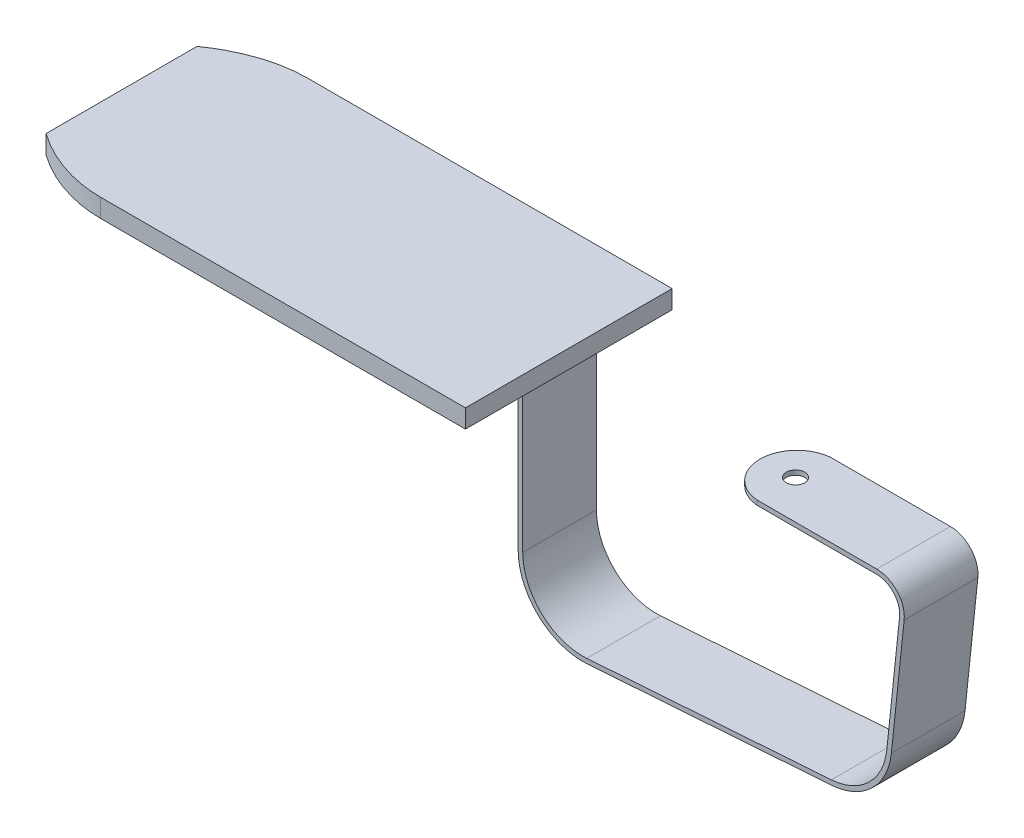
from build123d import *

# Parameters (mm, degrees)
BOSS_EXTRUDE1_DEPTH = 2.54
BOSS_EXTRUDE2_DEPTH = 1.27
BOSS_EXTRUDE4_DEPTH = 5.08
CUT_EXTRUDE1_DEPTH  = 10.16


with BuildPart() as part:
    # Sketch2 → Boss-Extrude1 (new body)
    with BuildSketch(Plane(origin=(0, 0, 0), x_dir=(1, 0, 0), z_dir=(0, 1, 0))):
        with BuildLine():
            Line((61.6585, 14.24305), (11.353119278, 14.24305))
            add(Edge.make_bspline(
                [(11.353119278, 14.24305), (10.327450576, 14.24305), (8.268396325, 14.047212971), (5.302466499, 13.251177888), (2.984919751, 12.238407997), (1.457568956, 11.373573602), (0.585224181, 10.807442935), (0.199247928, 10.543156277), (0, 10.408643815)],
                knots=[0, 0, 0, 0, 0.26559717, 0.53119434, 0.79679151, 0.929590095, 0.995989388, 1.06238868, 1.06238868, 1.06238868, 1.06238868], degree=3))
            Line((0, 10.408643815), (0, -10.408643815))
            add(Edge.make_bspline(
                [(0, -10.408643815), (0.199362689, -10.543233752), (0.585625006, -10.807716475), (1.458093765, -11.373904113), (2.984771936, -12.238095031), (5.290743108, -13.246690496), (8.260791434, -14.04631859), (10.325095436, -14.24305), (11.353119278, -14.24305)],
                knots=[-0.062352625, -0.062352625, -0.062352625, -0.062352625, 0.004044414, 0.070441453, 0.203235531, 0.468823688, 0.734411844, 1, 1, 1, 1], degree=3))
            Line((11.353119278, -14.24305), (61.6585, -14.24305))
            Line((61.6585, -14.24305), (61.6585, 14.24305))
        make_face()
        with BuildLine():
            Line((60.3885, 12.97305), (11.353119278, 12.97305))
            add(Edge.make_bspline(
                [(11.353119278, 12.97305), (10.450059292, 12.97305), (9.559200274, 12.892260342), (8.238540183, 12.667590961), (7.800947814, 12.575301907), (6.93079857, 12.357380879), (6.496809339, 12.231215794), (5.217581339, 11.809076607), (4.392169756, 11.469786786), (2.792058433, 10.684140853), (2.017192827, 10.23813493), (1.27, 9.733704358)],
                knots=[0, 0, 0, 0, 0.25, 0.25, 0.375, 0.375, 0.5, 0.5, 0.75, 0.75, 1, 1, 1, 1], degree=3))
            Line((1.27, 9.733704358), (1.27, -9.733704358))
            add(Edge.make_bspline(
                [(1.27, -9.733704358), (2.017624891, -10.238426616), (2.791972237, -10.684006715), (4.38895342, -11.46829921), (5.211756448, -11.806637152), (6.90950361, -12.3679143), (7.789205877, -12.590836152), (9.556782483, -12.892161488), (10.449674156, -12.97305), (11.353119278, -12.97305)],
                knots=[0, 0, 0, 0, 0.25, 0.25, 0.5, 0.5, 0.75, 0.75, 1, 1, 1, 1], degree=3))
            Line((11.353119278, -12.97305), (60.3885, -12.97305))
            Line((60.3885, -12.97305), (60.3885, 12.97305))
        make_face(mode=Mode.SUBTRACT)
    extrude(amount=-BOSS_EXTRUDE1_DEPTH)

    # Sketch3 → Boss-Extrude2 (add)
    with BuildSketch(Plane(origin=(0, 0, 0), x_dir=(1, 0, 0), z_dir=(0, 1, 0))):
        with BuildLine():
            Line((60.3885, 12.97305), (11.353119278, 12.97305))
            add(Edge.make_bspline(
                [(11.353119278, 12.97305), (10.450059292, 12.97305), (9.559200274, 12.892260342), (8.238540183, 12.667590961), (7.800947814, 12.575301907), (6.93079857, 12.357380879), (6.496809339, 12.231215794), (5.217581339, 11.809076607), (4.392169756, 11.469786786), (2.792058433, 10.684140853), (2.017192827, 10.23813493), (1.27, 9.733704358)],
                knots=[0, 0, 0, 0, 0.25, 0.25, 0.375, 0.375, 0.5, 0.5, 0.75, 0.75, 1, 1, 1, 1], degree=3))
            Line((1.27, 9.733704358), (1.27, -9.733704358))
            add(Edge.make_bspline(
                [(1.27, -9.733704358), (2.017624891, -10.238426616), (2.791972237, -10.684006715), (4.38895342, -11.46829921), (5.211756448, -11.806637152), (6.90950361, -12.3679143), (7.789205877, -12.590836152), (9.556782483, -12.892161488), (10.449674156, -12.97305), (11.353119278, -12.97305)],
                knots=[0, 0, 0, 0, 0.25, 0.25, 0.5, 0.5, 0.75, 0.75, 1, 1, 1, 1], degree=3))
            Line((11.353119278, -12.97305), (60.3885, -12.97305))
            Line((60.3885, -12.97305), (60.3885, 12.97305))
        make_face()
    extrude(amount=-BOSS_EXTRUDE2_DEPTH)


with BuildPart() as body_2:
    # Sketch4 → Boss-Extrude4 (new, symmetric)
    with BuildSketch(Plane.XY):
        with BuildLine():
            Line((59.7535, -2.54), (60.3885, -2.54))
            Line((60.3885, -2.54), (60.3885, -3.175))
            Line((60.3885, -3.175), (60.3885, -22.470642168))
            ThreePointArc((60.3885, -22.470642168), (63.013603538, -28.507966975), (69.219339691, -30.705533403))
            Line((69.219339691, -30.705533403), (102.944033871, -28.347273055))
            ThreePointArc((102.944033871, -28.347273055), (108.102599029, -26.050531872), (110.577972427, -20.975264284))
            Line((110.577972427, -20.975264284), (112.340926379, -4.201877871))
            ThreePointArc((112.340926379, -4.201877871), (111.542804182, -1.745510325), (109.183319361, -0.695))
            Line((109.183319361, -0.695), (88.014753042, -0.695))
            Line((88.014753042, -0.695), (88.014753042, -0.06))
            Line((88.014753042, -0.06), (109.183319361, -0.06))
            ThreePointArc((109.183319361, -0.06), (112.014701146, -1.32061239), (112.972447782, -4.268253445))
            Line((112.972447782, -4.268253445), (111.209493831, -21.041639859))
            ThreePointArc((111.209493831, -21.041639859), (108.543707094, -26.507312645), (102.988329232, -28.980726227))
            Line((102.988329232, -28.980726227), (69.263635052, -31.338986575))
            ThreePointArc((69.263635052, -31.338986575), (62.580534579, -28.972376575), (59.7535, -22.470642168))
            Line((59.7535, -22.470642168), (59.7535, -2.54))
        make_face()
    extrude(amount=BOSS_EXTRUDE4_DEPTH, both=True)

    # Sketch5 → Cut-Extrude1 (cut)
    with BuildSketch(Plane(origin=(0, -0.06, 0), x_dir=(1, 0, 0), z_dir=(0, 1, 0))):
        with BuildLine():
            Line((92.660699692, 5.08), (92.660699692, 6.643453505))
            Line((92.660699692, 6.643453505), (85.053554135, 6.643453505))
            Line((85.053554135, 6.643453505), (85.053554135, -6.84888771))
            Line((85.053554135, -6.84888771), (92.660699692, -6.84888771))
            Line((92.660699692, -6.84888771), (92.660699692, -5.08))
            ThreePointArc((92.660699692, -5.08), (88.014753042, 0), (92.660699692, 5.08))
        make_face()
        with BuildLine():
            add(Edge.make_bspline(
                [(93.930699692, 0.259119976), (93.930699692, 1.529114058), (92.660699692, 1.529114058), (91.390699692, 1.529114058), (91.390699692, 0.259119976)],
                knots=[3.141592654, 3.141592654, 3.141592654, 4.71238898, 4.71238898, 6.283185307, 6.283185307, 6.283185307], degree=2, weights=[1, 0.707106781, 1, 0.707106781, 1]))
            add(Edge.make_bspline(
                [(91.390699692, 0.259119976), (91.390699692, -1.010874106), (92.660699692, -1.010874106), (93.930699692, -1.010874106), (93.930699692, 0.259119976)],
                knots=[0, 0, 0, 1.570796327, 1.570796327, 3.141592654, 3.141592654, 3.141592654], degree=2, weights=[1, 0.707106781, 1, 0.707106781, 1]))
        make_face()
    extrude(amount=-CUT_EXTRUDE1_DEPTH, mode=Mode.SUBTRACT)


solid = Compound([part.part, body_2.part])
